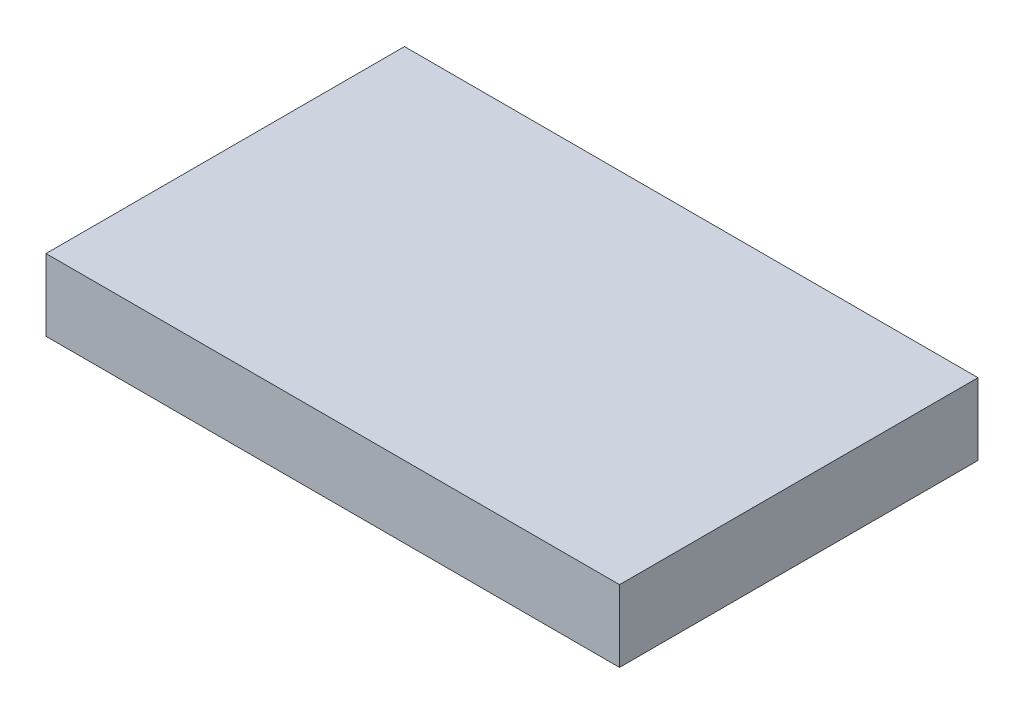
from build123d import *

# Parameters (mm, degrees)
SKETCH2_W      = 120
SKETCH2_H      = 75
EXTRUDE1_DEPTH = 15


with BuildPart() as part:
    # Sketch2 → Extrude1 (new body)
    with BuildSketch(Plane(origin=(0, 0, 0), x_dir=(1, 0, 0), z_dir=(0, 1, 0))):
        Rectangle(SKETCH2_W, SKETCH2_H)
    extrude(amount=EXTRUDE1_DEPTH)


solid = part.part
